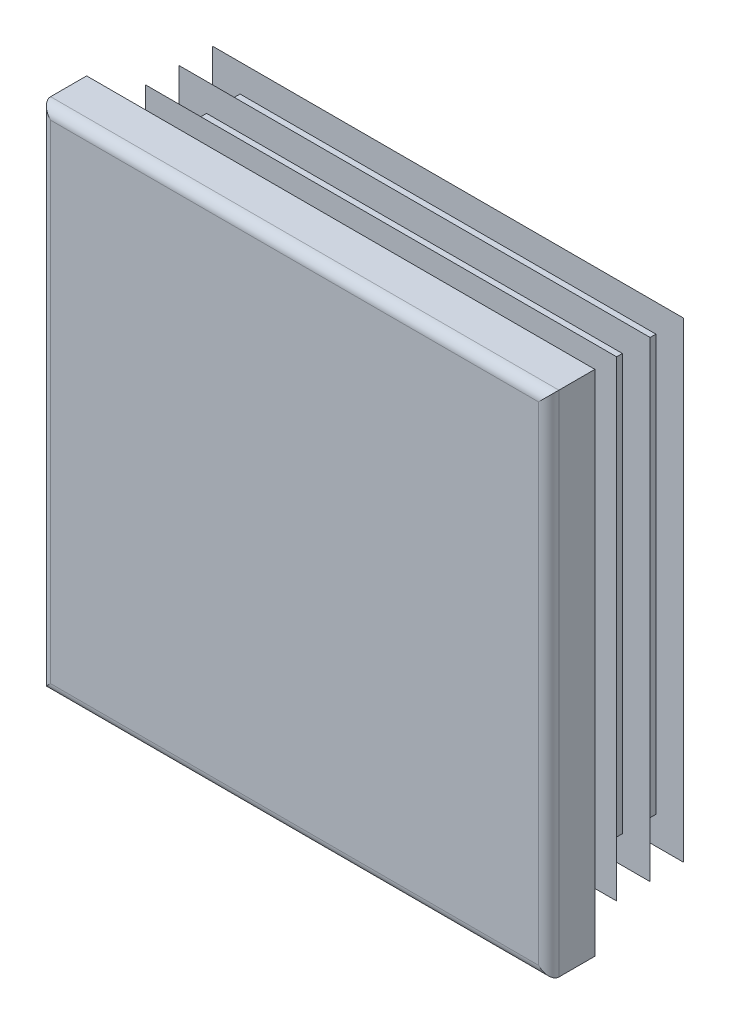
ISO-10303-21;
HEADER;
FILE_DESCRIPTION(('STEP AP214'),'2;1');
FILE_NAME('part.step','',(''),(''),'','','');
FILE_SCHEMA(('AUTOMOTIVE_DESIGN { 1 0 10303 214 1 1 1 1 }'));
ENDSEC;
DATA;
#1=APPLICATION_CONTEXT('core data for automotive mechanical design processes');
#2=APPLICATION_PROTOCOL_DEFINITION('international standard','automotive_design',2000,#1);
#3=PRODUCT_CONTEXT('',#1,'mechanical');
#4=PRODUCT('Part','Part','',(#3));
#5=PRODUCT_RELATED_PRODUCT_CATEGORY('part','',(#4));
#6=PRODUCT_DEFINITION_FORMATION('','',#4);
#7=PRODUCT_DEFINITION_CONTEXT('part definition',#1,'design');
#8=PRODUCT_DEFINITION('design','',#6,#7);
#9=PRODUCT_DEFINITION_SHAPE('','',#8);
#10=(LENGTH_UNIT() NAMED_UNIT(*) SI_UNIT(.MILLI.,.METRE.));
#11=(NAMED_UNIT(*) PLANE_ANGLE_UNIT() SI_UNIT($,.RADIAN.));
#12=(NAMED_UNIT(*) SI_UNIT($,.STERADIAN.) SOLID_ANGLE_UNIT());
#13=UNCERTAINTY_MEASURE_WITH_UNIT(LENGTH_MEASURE(1.E-05),#10,'distance_accuracy_value','');
#14=(GEOMETRIC_REPRESENTATION_CONTEXT(3) GLOBAL_UNCERTAINTY_ASSIGNED_CONTEXT((#13)) GLOBAL_UNIT_ASSIGNED_CONTEXT((#10,
#11,#12)) REPRESENTATION_CONTEXT('',''));
#15=CARTESIAN_POINT('',(0.,0.,0.));
#16=DIRECTION('',(0.,0.,1.));
#17=DIRECTION('',(1.,0.,0.));
#18=AXIS2_PLACEMENT_3D('',#15,#16,#17);
#19=CARTESIAN_POINT('',(26.4,-27.5,5.));
#20=DIRECTION('',(0.,0.,-1.));
#21=DIRECTION('',(0.,1.,0.));
#22=AXIS2_PLACEMENT_3D('',#19,#20,#21);
#23=PLANE('',#22);
#24=DIRECTION('',(0.,1.,0.));
#25=VECTOR('',#24,1.);
#26=CARTESIAN_POINT('',(-26.4,-27.5,5.));
#27=LINE('',#26,#25);
#28=CARTESIAN_POINT('',(-26.4,-26.4,5.));
#29=VERTEX_POINT('',#28);
#30=CARTESIAN_POINT('',(-26.4,26.4,5.));
#31=VERTEX_POINT('',#30);
#32=EDGE_CURVE('E262',#29,#31,#27,.T.);
#33=ORIENTED_EDGE('',*,*,#32,.F.);
#34=DIRECTION('',(-1.,0.,0.));
#35=VECTOR('',#34,1.);
#36=CARTESIAN_POINT('',(27.5,-26.4,5.));
#37=LINE('',#36,#35);
#38=CARTESIAN_POINT('',(26.4,-26.4,5.));
#39=VERTEX_POINT('',#38);
#40=EDGE_CURVE('E432',#39,#29,#37,.T.);
#41=ORIENTED_EDGE('',*,*,#40,.F.);
#42=DIRECTION('',(0.,1.,0.));
#43=VECTOR('',#42,1.);
#44=CARTESIAN_POINT('',(26.4,-27.5,5.));
#45=LINE('',#44,#43);
#46=CARTESIAN_POINT('',(26.4,26.4,5.));
#47=VERTEX_POINT('',#46);
#48=EDGE_CURVE('E257',#39,#47,#45,.T.);
#49=ORIENTED_EDGE('',*,*,#48,.T.);
#50=DIRECTION('',(-1.,0.,0.));
#51=VECTOR('',#50,1.);
#52=CARTESIAN_POINT('',(27.5,26.4,5.));
#53=LINE('',#52,#51);
#54=EDGE_CURVE('E534',#47,#31,#53,.T.);
#55=ORIENTED_EDGE('',*,*,#54,.T.);
#56=EDGE_LOOP('',(#33,#41,#49,#55));
#57=FACE_BOUND('',#56,.T.);
#58=ADVANCED_FACE('F14',(#57),#23,.F.);
#59=CARTESIAN_POINT('',(-26.4,-27.5,3.9));
#60=DIRECTION('',(0.,1.,0.));
#61=DIRECTION('',(-1.,0.,0.));
#62=AXIS2_PLACEMENT_3D('',#59,#60,#61);
#63=CYLINDRICAL_SURFACE('',#62,1.1);
#64=DIRECTION('',(0.,1.,0.));
#65=VECTOR('',#64,1.);
#66=CARTESIAN_POINT('',(-27.5,-27.5,3.9));
#67=LINE('',#66,#65);
#68=CARTESIAN_POINT('',(-27.5,-27.5,3.9));
#69=VERTEX_POINT('',#68);
#70=CARTESIAN_POINT('',(-27.5,27.5,3.9));
#71=VERTEX_POINT('',#70);
#72=EDGE_CURVE('E354',#69,#71,#67,.T.);
#73=ORIENTED_EDGE('',*,*,#72,.F.);
#74=CARTESIAN_POINT('',(-26.4,-26.4,3.9));
#75=DIRECTION('',(-0.707106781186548,0.707106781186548,0.));
#76=DIRECTION('',(0.707106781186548,0.707106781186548,0.));
#77=AXIS2_PLACEMENT_3D('',#74,#75,#76);
#78=ELLIPSE('',#77,1.55563491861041,1.1);
#79=EDGE_CURVE('E59',#69,#29,#78,.T.);
#80=ORIENTED_EDGE('',*,*,#79,.T.);
#81=ORIENTED_EDGE('',*,*,#32,.T.);
#82=CARTESIAN_POINT('',(-26.4,26.4,3.9));
#83=DIRECTION('',(0.707106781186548,0.707106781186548,0.));
#84=DIRECTION('',(-0.707106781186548,0.707106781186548,0.));
#85=AXIS2_PLACEMENT_3D('',#82,#83,#84);
#86=ELLIPSE('',#85,1.55563491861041,1.1);
#87=EDGE_CURVE('E258',#31,#71,#86,.F.);
#88=ORIENTED_EDGE('',*,*,#87,.T.);
#89=EDGE_LOOP('',(#73,#80,#81,#88));
#90=FACE_BOUND('',#89,.T.);
#91=ADVANCED_FACE('F16',(#90),#63,.T.);
#92=CARTESIAN_POINT('',(-27.5,-27.5,3.9));
#93=DIRECTION('',(1.,0.,0.));
#94=DIRECTION('',(0.,1.,0.));
#95=AXIS2_PLACEMENT_3D('',#92,#93,#94);
#96=PLANE('',#95);
#97=DIRECTION('',(0.,0.,-1.));
#98=VECTOR('',#97,1.);
#99=CARTESIAN_POINT('',(-27.5,27.5,3.9));
#100=LINE('',#99,#98);
#101=CARTESIAN_POINT('',(-27.5,27.5,0.));
#102=VERTEX_POINT('',#101);
#103=EDGE_CURVE('E519',#71,#102,#100,.T.);
#104=ORIENTED_EDGE('',*,*,#103,.T.);
#105=DIRECTION('',(0.,1.,0.));
#106=VECTOR('',#105,1.);
#107=CARTESIAN_POINT('',(-27.5,-27.5,0.));
#108=LINE('',#107,#106);
#109=CARTESIAN_POINT('',(-27.5,-27.5,0.));
#110=VERTEX_POINT('',#109);
#111=EDGE_CURVE('E352',#110,#102,#108,.T.);
#112=ORIENTED_EDGE('',*,*,#111,.F.);
#113=DIRECTION('',(0.,0.,-1.));
#114=VECTOR('',#113,1.);
#115=CARTESIAN_POINT('',(-27.5,-27.5,3.9));
#116=LINE('',#115,#114);
#117=EDGE_CURVE('E520',#69,#110,#116,.T.);
#118=ORIENTED_EDGE('',*,*,#117,.F.);
#119=ORIENTED_EDGE('',*,*,#72,.T.);
#120=EDGE_LOOP('',(#104,#112,#118,#119));
#121=FACE_BOUND('',#120,.T.);
#122=ADVANCED_FACE('F604',(#121),#96,.F.);
#123=CARTESIAN_POINT('',(-22.5,-27.5,0.));
#124=DIRECTION('',(1.,0.,0.));
#125=DIRECTION('',(0.,1.,0.));
#126=AXIS2_PLACEMENT_3D('',#123,#124,#125);
#127=PLANE('',#126);
#128=DIRECTION('',(0.,1.,0.));
#129=VECTOR('',#128,1.);
#130=CARTESIAN_POINT('',(-22.5,-27.5,0.));
#131=LINE('',#130,#129);
#132=CARTESIAN_POINT('',(-22.5,-22.5,0.));
#133=VERTEX_POINT('',#132);
#134=CARTESIAN_POINT('',(-22.5,22.5,0.));
#135=VERTEX_POINT('',#134);
#136=EDGE_CURVE('E349',#133,#135,#131,.T.);
#137=ORIENTED_EDGE('',*,*,#136,.T.);
#138=DIRECTION('',(0.,0.,-1.));
#139=VECTOR('',#138,1.);
#140=CARTESIAN_POINT('',(-22.5,22.5,0.));
#141=LINE('',#140,#139);
#142=CARTESIAN_POINT('',(-22.5,22.5,-0.725));
#143=VERTEX_POINT('',#142);
#144=EDGE_CURVE('E445',#135,#143,#141,.T.);
#145=ORIENTED_EDGE('',*,*,#144,.T.);
#146=DIRECTION('',(0.,1.,0.));
#147=VECTOR('',#146,1.);
#148=CARTESIAN_POINT('',(-22.5,-27.5,-0.725));
#149=LINE('',#148,#147);
#150=CARTESIAN_POINT('',(-22.5,-22.5,-0.725));
#151=VERTEX_POINT('',#150);
#152=EDGE_CURVE('E346',#151,#143,#149,.T.);
#153=ORIENTED_EDGE('',*,*,#152,.F.);
#154=DIRECTION('',(0.,0.,1.));
#155=VECTOR('',#154,1.);
#156=CARTESIAN_POINT('',(-22.5,-22.5,0.));
#157=LINE('',#156,#155);
#158=EDGE_CURVE('E439',#151,#133,#157,.T.);
#159=ORIENTED_EDGE('',*,*,#158,.T.);
#160=EDGE_LOOP('',(#137,#145,#153,#159));
#161=FACE_BOUND('',#160,.T.);
#162=ADVANCED_FACE('F728',(#161),#127,.F.);
#163=CARTESIAN_POINT('',(-25.5,-27.5,-0.725));
#164=DIRECTION('',(0.573576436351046,0.,0.819152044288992));
#165=DIRECTION('',(-0.819152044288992,0.,0.573576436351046));
#166=AXIS2_PLACEMENT_3D('',#163,#164,#165);
#167=PLANE('',#166);
#168=DIRECTION('',(0.,1.,0.));
#169=VECTOR('',#168,1.);
#170=CARTESIAN_POINT('',(-25.5,-27.5,-0.725));
#171=LINE('',#170,#169);
#172=CARTESIAN_POINT('',(-25.5,-25.5,-0.725));
#173=VERTEX_POINT('',#172);
#174=CARTESIAN_POINT('',(-25.5,25.5,-0.725));
#175=VERTEX_POINT('',#174);
#176=EDGE_CURVE('E344',#173,#175,#171,.T.);
#177=ORIENTED_EDGE('',*,*,#176,.T.);
#178=DIRECTION('',(0.633687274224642,-0.633687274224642,-0.443712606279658));
#179=VECTOR('',#178,1.);
#180=CARTESIAN_POINT('',(-4.2173432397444,4.21734323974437,-15.6272766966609));
#181=LINE('',#180,#179);
#182=CARTESIAN_POINT('',(-22.5,22.5,-2.82562261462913));
#183=VERTEX_POINT('',#182);
#184=EDGE_CURVE('E457',#175,#183,#181,.T.);
#185=ORIENTED_EDGE('',*,*,#184,.T.);
#186=DIRECTION('',(0.,1.,0.));
#187=VECTOR('',#186,1.);
#188=CARTESIAN_POINT('',(-22.5,-27.5,-2.82562261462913));
#189=LINE('',#188,#187);
#190=CARTESIAN_POINT('',(-22.5,-22.5,-2.82562261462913));
#191=VERTEX_POINT('',#190);
#192=EDGE_CURVE('E341',#191,#183,#189,.T.);
#193=ORIENTED_EDGE('',*,*,#192,.F.);
#194=DIRECTION('',(-0.633687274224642,-0.633687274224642,0.443712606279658));
#195=VECTOR('',#194,1.);
#196=CARTESIAN_POINT('',(-26.3031191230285,-26.3031191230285,-0.162649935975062));
#197=LINE('',#196,#195);
#198=EDGE_CURVE('E451',#191,#173,#197,.T.);
#199=ORIENTED_EDGE('',*,*,#198,.T.);
#200=EDGE_LOOP('',(#177,#185,#193,#199));
#201=FACE_BOUND('',#200,.T.);
#202=ADVANCED_FACE('F732',(#201),#167,.F.);
#203=CARTESIAN_POINT('',(-22.5,-27.5,-2.82562261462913));
#204=DIRECTION('',(1.,0.,0.));
#205=DIRECTION('',(0.,1.,0.));
#206=AXIS2_PLACEMENT_3D('',#203,#204,#205);
#207=PLANE('',#206);
#208=ORIENTED_EDGE('',*,*,#192,.T.);
#209=DIRECTION('',(0.,0.,-1.));
#210=VECTOR('',#209,1.);
#211=CARTESIAN_POINT('',(-22.5,22.5,-2.82562261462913));
#212=LINE('',#211,#210);
#213=CARTESIAN_POINT('',(-22.5,22.5,-4.35));
#214=VERTEX_POINT('',#213);
#215=EDGE_CURVE('E463',#183,#214,#212,.T.);
#216=ORIENTED_EDGE('',*,*,#215,.T.);
#217=DIRECTION('',(0.,1.,0.));
#218=VECTOR('',#217,1.);
#219=CARTESIAN_POINT('',(-22.5,-27.5,-4.35));
#220=LINE('',#219,#218);
#221=CARTESIAN_POINT('',(-22.5,-22.5,-4.35));
#222=VERTEX_POINT('',#221);
#223=EDGE_CURVE('E338',#222,#214,#220,.T.);
#224=ORIENTED_EDGE('',*,*,#223,.F.);
#225=DIRECTION('',(0.,0.,1.));
#226=VECTOR('',#225,1.);
#227=CARTESIAN_POINT('',(-22.5,-22.5,-2.82562261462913));
#228=LINE('',#227,#226);
#229=EDGE_CURVE('E460',#222,#191,#228,.T.);
#230=ORIENTED_EDGE('',*,*,#229,.T.);
#231=EDGE_LOOP('',(#208,#216,#224,#230));
#232=FACE_BOUND('',#231,.T.);
#233=ADVANCED_FACE('F738',(#232),#207,.F.);
#234=CARTESIAN_POINT('',(-25.5,-27.5,-4.35));
#235=DIRECTION('',(0.573576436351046,0.,0.819152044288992));
#236=DIRECTION('',(-0.819152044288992,0.,0.573576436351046));
#237=AXIS2_PLACEMENT_3D('',#234,#235,#236);
#238=PLANE('',#237);
#239=DIRECTION('',(0.,1.,0.));
#240=VECTOR('',#239,1.);
#241=CARTESIAN_POINT('',(-25.5,-27.5,-4.35));
#242=LINE('',#241,#240);
#243=CARTESIAN_POINT('',(-25.5,-25.5,-4.35));
#244=VERTEX_POINT('',#243);
#245=CARTESIAN_POINT('',(-25.5,25.5,-4.35));
#246=VERTEX_POINT('',#245);
#247=EDGE_CURVE('E336',#244,#246,#242,.T.);
#248=ORIENTED_EDGE('',*,*,#247,.T.);
#249=DIRECTION('',(0.633687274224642,-0.633687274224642,-0.443712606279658));
#250=VECTOR('',#249,1.);
#251=CARTESIAN_POINT('',(-4.21734323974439,4.2173432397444,-19.2522766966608));
#252=LINE('',#251,#250);
#253=CARTESIAN_POINT('',(-22.5,22.5,-6.45062261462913));
#254=VERTEX_POINT('',#253);
#255=EDGE_CURVE('E475',#246,#254,#252,.T.);
#256=ORIENTED_EDGE('',*,*,#255,.T.);
#257=DIRECTION('',(0.,1.,0.));
#258=VECTOR('',#257,1.);
#259=CARTESIAN_POINT('',(-22.5,-27.5,-6.45062261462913));
#260=LINE('',#259,#258);
#261=CARTESIAN_POINT('',(-22.5,-22.5,-6.45062261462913));
#262=VERTEX_POINT('',#261);
#263=EDGE_CURVE('E333',#262,#254,#260,.T.);
#264=ORIENTED_EDGE('',*,*,#263,.F.);
#265=DIRECTION('',(-0.633687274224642,-0.633687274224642,0.443712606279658));
#266=VECTOR('',#265,1.);
#267=CARTESIAN_POINT('',(-26.3031191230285,-26.3031191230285,-3.78764993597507));
#268=LINE('',#267,#266);
#269=EDGE_CURVE('E469',#262,#244,#268,.T.);
#270=ORIENTED_EDGE('',*,*,#269,.T.);
#271=EDGE_LOOP('',(#248,#256,#264,#270));
#272=FACE_BOUND('',#271,.T.);
#273=ADVANCED_FACE('F742',(#272),#238,.F.);
#274=CARTESIAN_POINT('',(-22.5,-27.5,-6.45062261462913));
#275=DIRECTION('',(1.,0.,0.));
#276=DIRECTION('',(0.,1.,0.));
#277=AXIS2_PLACEMENT_3D('',#274,#275,#276);
#278=PLANE('',#277);
#279=ORIENTED_EDGE('',*,*,#263,.T.);
#280=DIRECTION('',(0.,0.,-1.));
#281=VECTOR('',#280,1.);
#282=CARTESIAN_POINT('',(-22.5,22.5,-6.45062261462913));
#283=LINE('',#282,#281);
#284=CARTESIAN_POINT('',(-22.5,22.5,-7.975));
#285=VERTEX_POINT('',#284);
#286=EDGE_CURVE('E481',#254,#285,#283,.T.);
#287=ORIENTED_EDGE('',*,*,#286,.T.);
#288=DIRECTION('',(0.,1.,0.));
#289=VECTOR('',#288,1.);
#290=CARTESIAN_POINT('',(-22.5,-27.5,-7.975));
#291=LINE('',#290,#289);
#292=CARTESIAN_POINT('',(-22.5,-22.5,-7.975));
#293=VERTEX_POINT('',#292);
#294=EDGE_CURVE('E330',#293,#285,#291,.T.);
#295=ORIENTED_EDGE('',*,*,#294,.F.);
#296=DIRECTION('',(0.,0.,1.));
#297=VECTOR('',#296,1.);
#298=CARTESIAN_POINT('',(-22.5,-22.5,-6.45062261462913));
#299=LINE('',#298,#297);
#300=EDGE_CURVE('E478',#293,#262,#299,.T.);
#301=ORIENTED_EDGE('',*,*,#300,.T.);
#302=EDGE_LOOP('',(#279,#287,#295,#301));
#303=FACE_BOUND('',#302,.T.);
#304=ADVANCED_FACE('F746',(#303),#278,.F.);
#305=CARTESIAN_POINT('',(-25.5,-27.5,-7.975));
#306=DIRECTION('',(0.573576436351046,0.,0.819152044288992));
#307=DIRECTION('',(-0.819152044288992,0.,0.573576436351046));
#308=AXIS2_PLACEMENT_3D('',#305,#306,#307);
#309=PLANE('',#308);
#310=DIRECTION('',(0.,1.,0.));
#311=VECTOR('',#310,1.);
#312=CARTESIAN_POINT('',(-25.5,-27.5,-7.975));
#313=LINE('',#312,#311);
#314=CARTESIAN_POINT('',(-25.5,-25.5,-7.975));
#315=VERTEX_POINT('',#314);
#316=CARTESIAN_POINT('',(-25.5,25.5,-7.975));
#317=VERTEX_POINT('',#316);
#318=EDGE_CURVE('E328',#315,#317,#313,.T.);
#319=ORIENTED_EDGE('',*,*,#318,.T.);
#320=DIRECTION('',(0.633687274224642,-0.633687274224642,-0.443712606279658));
#321=VECTOR('',#320,1.);
#322=CARTESIAN_POINT('',(-4.2173432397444,4.2173432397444,-22.8772766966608));
#323=LINE('',#322,#321);
#324=CARTESIAN_POINT('',(-22.5,22.5,-10.0756226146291));
#325=VERTEX_POINT('',#324);
#326=EDGE_CURVE('E493',#317,#325,#323,.T.);
#327=ORIENTED_EDGE('',*,*,#326,.T.);
#328=DIRECTION('',(0.,1.,0.));
#329=VECTOR('',#328,1.);
#330=CARTESIAN_POINT('',(-22.5,-27.5,-10.0756226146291));
#331=LINE('',#330,#329);
#332=CARTESIAN_POINT('',(-22.5,-22.5,-10.0756226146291));
#333=VERTEX_POINT('',#332);
#334=EDGE_CURVE('E325',#333,#325,#331,.T.);
#335=ORIENTED_EDGE('',*,*,#334,.F.);
#336=DIRECTION('',(-0.633687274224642,-0.633687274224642,0.443712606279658));
#337=VECTOR('',#336,1.);
#338=CARTESIAN_POINT('',(-26.3031191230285,-26.3031191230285,-7.41264993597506));
#339=LINE('',#338,#337);
#340=EDGE_CURVE('E487',#333,#315,#339,.T.);
#341=ORIENTED_EDGE('',*,*,#340,.T.);
#342=EDGE_LOOP('',(#319,#327,#335,#341));
#343=FACE_BOUND('',#342,.T.);
#344=ADVANCED_FACE('F668',(#343),#309,.F.);
#345=CARTESIAN_POINT('',(-22.5,-27.5,-10.0756226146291));
#346=DIRECTION('',(1.,0.,0.));
#347=DIRECTION('',(0.,1.,0.));
#348=AXIS2_PLACEMENT_3D('',#345,#346,#347);
#349=PLANE('',#348);
#350=ORIENTED_EDGE('',*,*,#334,.T.);
#351=DIRECTION('',(0.,0.,-1.));
#352=VECTOR('',#351,1.);
#353=CARTESIAN_POINT('',(-22.5,22.5,-10.0756226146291));
#354=LINE('',#353,#352);
#355=CARTESIAN_POINT('',(-22.5,22.5,-11.6));
#356=VERTEX_POINT('',#355);
#357=EDGE_CURVE('E499',#325,#356,#354,.T.);
#358=ORIENTED_EDGE('',*,*,#357,.T.);
#359=DIRECTION('',(0.,1.,0.));
#360=VECTOR('',#359,1.);
#361=CARTESIAN_POINT('',(-22.5,-27.5,-11.6));
#362=LINE('',#361,#360);
#363=CARTESIAN_POINT('',(-22.5,-22.5,-11.6));
#364=VERTEX_POINT('',#363);
#365=EDGE_CURVE('E322',#364,#356,#362,.T.);
#366=ORIENTED_EDGE('',*,*,#365,.F.);
#367=DIRECTION('',(0.,0.,1.));
#368=VECTOR('',#367,1.);
#369=CARTESIAN_POINT('',(-22.5,-22.5,-10.0756226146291));
#370=LINE('',#369,#368);
#371=EDGE_CURVE('E496',#364,#333,#370,.T.);
#372=ORIENTED_EDGE('',*,*,#371,.T.);
#373=EDGE_LOOP('',(#350,#358,#366,#372));
#374=FACE_BOUND('',#373,.T.);
#375=ADVANCED_FACE('F665',(#374),#349,.F.);
#376=CARTESIAN_POINT('',(-25.5,-27.5,-11.6));
#377=DIRECTION('',(0.573576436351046,0.,0.819152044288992));
#378=DIRECTION('',(-0.819152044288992,0.,0.573576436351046));
#379=AXIS2_PLACEMENT_3D('',#376,#377,#378);
#380=PLANE('',#379);
#381=DIRECTION('',(0.,1.,0.));
#382=VECTOR('',#381,1.);
#383=CARTESIAN_POINT('',(-25.5,-27.5,-11.6));
#384=LINE('',#383,#382);
#385=CARTESIAN_POINT('',(-25.5,-25.5,-11.6));
#386=VERTEX_POINT('',#385);
#387=CARTESIAN_POINT('',(-25.5,25.5,-11.6));
#388=VERTEX_POINT('',#387);
#389=EDGE_CURVE('E320',#386,#388,#384,.T.);
#390=ORIENTED_EDGE('',*,*,#389,.T.);
#391=DIRECTION('',(0.633687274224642,-0.633687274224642,-0.443712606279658));
#392=VECTOR('',#391,1.);
#393=CARTESIAN_POINT('',(-4.2173432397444,4.2173432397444,-26.5022766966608));
#394=LINE('',#393,#392);
#395=CARTESIAN_POINT('',(-22.5,22.5,-13.7006226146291));
#396=VERTEX_POINT('',#395);
#397=EDGE_CURVE('E511',#388,#396,#394,.T.);
#398=ORIENTED_EDGE('',*,*,#397,.T.);
#399=DIRECTION('',(0.,1.,0.));
#400=VECTOR('',#399,1.);
#401=CARTESIAN_POINT('',(-22.5,-27.5,-13.7006226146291));
#402=LINE('',#401,#400);
#403=CARTESIAN_POINT('',(-22.5,-22.5,-13.7006226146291));
#404=VERTEX_POINT('',#403);
#405=EDGE_CURVE('E317',#404,#396,#402,.T.);
#406=ORIENTED_EDGE('',*,*,#405,.F.);
#407=DIRECTION('',(-0.633687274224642,-0.633687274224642,0.443712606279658));
#408=VECTOR('',#407,1.);
#409=CARTESIAN_POINT('',(-26.3031191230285,-26.3031191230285,-11.0376499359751));
#410=LINE('',#409,#408);
#411=EDGE_CURVE('E505',#404,#386,#410,.T.);
#412=ORIENTED_EDGE('',*,*,#411,.T.);
#413=EDGE_LOOP('',(#390,#398,#406,#412));
#414=FACE_BOUND('',#413,.T.);
#415=ADVANCED_FACE('F580',(#414),#380,.F.);
#416=CARTESIAN_POINT('',(-22.5,-27.5,-13.7006226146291));
#417=DIRECTION('',(1.,0.,0.));
#418=DIRECTION('',(0.,1.,0.));
#419=AXIS2_PLACEMENT_3D('',#416,#417,#418);
#420=PLANE('',#419);
#421=ORIENTED_EDGE('',*,*,#405,.T.);
#422=DIRECTION('',(0.,0.,-1.));
#423=VECTOR('',#422,1.);
#424=CARTESIAN_POINT('',(-22.5,22.5,-13.7006226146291));
#425=LINE('',#424,#423);
#426=CARTESIAN_POINT('',(-22.5,22.5,-14.5));
#427=VERTEX_POINT('',#426);
#428=EDGE_CURVE('E517',#396,#427,#425,.T.);
#429=ORIENTED_EDGE('',*,*,#428,.T.);
#430=DIRECTION('',(0.,1.,0.));
#431=VECTOR('',#430,1.);
#432=CARTESIAN_POINT('',(-22.5,-27.5,-14.5));
#433=LINE('',#432,#431);
#434=CARTESIAN_POINT('',(-22.5,-22.5,-14.5));
#435=VERTEX_POINT('',#434);
#436=EDGE_CURVE('E314',#435,#427,#433,.T.);
#437=ORIENTED_EDGE('',*,*,#436,.F.);
#438=DIRECTION('',(0.,0.,1.));
#439=VECTOR('',#438,1.);
#440=CARTESIAN_POINT('',(-22.5,-22.5,-13.7006226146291));
#441=LINE('',#440,#439);
#442=EDGE_CURVE('E514',#435,#404,#441,.T.);
#443=ORIENTED_EDGE('',*,*,#442,.T.);
#444=EDGE_LOOP('',(#421,#429,#437,#443));
#445=FACE_BOUND('',#444,.T.);
#446=ADVANCED_FACE('F582',(#445),#420,.F.);
#447=CARTESIAN_POINT('',(-22.5,-27.5,-14.5));
#448=DIRECTION('',(0.,0.,1.));
#449=DIRECTION('',(0.,-1.,0.));
#450=AXIS2_PLACEMENT_3D('',#447,#448,#449);
#451=PLANE('',#450);
#452=ORIENTED_EDGE('',*,*,#436,.T.);
#453=DIRECTION('',(-1.,0.,0.));
#454=VECTOR('',#453,1.);
#455=CARTESIAN_POINT('',(27.5,22.5,-14.5));
#456=LINE('',#455,#454);
#457=CARTESIAN_POINT('',(22.5,22.5,-14.5));
#458=VERTEX_POINT('',#457);
#459=EDGE_CURVE('E388',#458,#427,#456,.T.);
#460=ORIENTED_EDGE('',*,*,#459,.F.);
#461=DIRECTION('',(0.,1.,0.));
#462=VECTOR('',#461,1.);
#463=CARTESIAN_POINT('',(22.5,-27.5,-14.5));
#464=LINE('',#463,#462);
#465=CARTESIAN_POINT('',(22.5,-22.5,-14.5));
#466=VERTEX_POINT('',#465);
#467=EDGE_CURVE('E311',#466,#458,#464,.T.);
#468=ORIENTED_EDGE('',*,*,#467,.F.);
#469=DIRECTION('',(-1.,0.,0.));
#470=VECTOR('',#469,1.);
#471=CARTESIAN_POINT('',(27.5,-22.5,-14.5));
#472=LINE('',#471,#470);
#473=EDGE_CURVE('E386',#466,#435,#472,.T.);
#474=ORIENTED_EDGE('',*,*,#473,.T.);
#475=EDGE_LOOP('',(#452,#460,#468,#474));
#476=FACE_BOUND('',#475,.T.);
#477=ADVANCED_FACE('F385',(#476),#451,.F.);
#478=CARTESIAN_POINT('',(22.5,-27.5,-14.5));
#479=DIRECTION('',(-1.,0.,0.));
#480=DIRECTION('',(0.,-1.,0.));
#481=AXIS2_PLACEMENT_3D('',#478,#479,#480);
#482=PLANE('',#481);
#483=ORIENTED_EDGE('',*,*,#467,.T.);
#484=DIRECTION('',(0.,0.,1.));
#485=VECTOR('',#484,1.);
#486=CARTESIAN_POINT('',(22.5,22.5,-14.5));
#487=LINE('',#486,#485);
#488=CARTESIAN_POINT('',(22.5,22.5,-13.7006226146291));
#489=VERTEX_POINT('',#488);
#490=EDGE_CURVE('E9',#458,#489,#487,.T.);
#491=ORIENTED_EDGE('',*,*,#490,.T.);
#492=DIRECTION('',(0.,1.,0.));
#493=VECTOR('',#492,1.);
#494=CARTESIAN_POINT('',(22.5,-27.5,-13.7006226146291));
#495=LINE('',#494,#493);
#496=CARTESIAN_POINT('',(22.5,-22.5,-13.7006226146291));
#497=VERTEX_POINT('',#496);
#498=EDGE_CURVE('E308',#497,#489,#495,.T.);
#499=ORIENTED_EDGE('',*,*,#498,.F.);
#500=DIRECTION('',(0.,0.,-1.));
#501=VECTOR('',#500,1.);
#502=CARTESIAN_POINT('',(22.5,-22.5,-14.5));
#503=LINE('',#502,#501);
#504=EDGE_CURVE('E23',#497,#466,#503,.T.);
#505=ORIENTED_EDGE('',*,*,#504,.T.);
#506=EDGE_LOOP('',(#483,#491,#499,#505));
#507=FACE_BOUND('',#506,.T.);
#508=ADVANCED_FACE('F378',(#507),#482,.F.);
#509=CARTESIAN_POINT('',(22.5,-27.5,-13.7006226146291));
#510=DIRECTION('',(-0.573576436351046,0.,0.819152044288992));
#511=DIRECTION('',(-0.819152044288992,0.,-0.573576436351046));
#512=AXIS2_PLACEMENT_3D('',#509,#510,#511);
#513=PLANE('',#512);
#514=ORIENTED_EDGE('',*,*,#498,.T.);
#515=DIRECTION('',(0.633687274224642,0.633687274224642,0.443712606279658));
#516=VECTOR('',#515,1.);
#517=CARTESIAN_POINT('',(2.42202192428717,2.42202192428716,-27.7593742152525));
#518=LINE('',#517,#516);
#519=CARTESIAN_POINT('',(25.5,25.5,-11.6));
#520=VERTEX_POINT('',#519);
#521=EDGE_CURVE('E508',#489,#520,#518,.T.);
#522=ORIENTED_EDGE('',*,*,#521,.T.);
#523=DIRECTION('',(0.,1.,0.));
#524=VECTOR('',#523,1.);
#525=CARTESIAN_POINT('',(25.5,-27.5,-11.6));
#526=LINE('',#525,#524);
#527=CARTESIAN_POINT('',(25.5,-25.5,-11.6));
#528=VERTEX_POINT('',#527);
#529=EDGE_CURVE('E305',#528,#520,#526,.T.);
#530=ORIENTED_EDGE('',*,*,#529,.F.);
#531=DIRECTION('',(-0.633687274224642,0.633687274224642,-0.443712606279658));
#532=VECTOR('',#531,1.);
#533=CARTESIAN_POINT('',(24.5077978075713,-24.5077978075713,-12.2947474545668));
#534=LINE('',#533,#532);
#535=EDGE_CURVE('E502',#528,#497,#534,.T.);
#536=ORIENTED_EDGE('',*,*,#535,.T.);
#537=EDGE_LOOP('',(#514,#522,#530,#536));
#538=FACE_BOUND('',#537,.T.);
#539=ADVANCED_FACE('F588',(#538),#513,.F.);
#540=CARTESIAN_POINT('',(25.5,-27.5,-11.6));
#541=DIRECTION('',(0.,0.,-1.));
#542=DIRECTION('',(0.,1.,0.));
#543=AXIS2_PLACEMENT_3D('',#540,#541,#542);
#544=PLANE('',#543);
#545=ORIENTED_EDGE('',*,*,#529,.T.);
#546=DIRECTION('',(-1.,0.,0.));
#547=VECTOR('',#546,1.);
#548=CARTESIAN_POINT('',(27.5,25.5,-11.6));
#549=LINE('',#548,#547);
#550=EDGE_CURVE('E394',#520,#388,#549,.T.);
#551=ORIENTED_EDGE('',*,*,#550,.T.);
#552=ORIENTED_EDGE('',*,*,#389,.F.);
#553=DIRECTION('',(-1.,0.,0.));
#554=VECTOR('',#553,1.);
#555=CARTESIAN_POINT('',(27.5,-25.5,-11.6));
#556=LINE('',#555,#554);
#557=EDGE_CURVE('E401',#528,#386,#556,.T.);
#558=ORIENTED_EDGE('',*,*,#557,.F.);
#559=EDGE_LOOP('',(#545,#551,#552,#558));
#560=FACE_BOUND('',#559,.T.);
#561=ORIENTED_EDGE('',*,*,#365,.T.);
#562=DIRECTION('',(-1.,0.,0.));
#563=VECTOR('',#562,1.);
#564=CARTESIAN_POINT('',(27.5,22.5,-11.6));
#565=LINE('',#564,#563);
#566=CARTESIAN_POINT('',(22.5,22.5,-11.6));
#567=VERTEX_POINT('',#566);
#568=EDGE_CURVE('E567',#567,#356,#565,.T.);
#569=ORIENTED_EDGE('',*,*,#568,.F.);
#570=DIRECTION('',(0.,1.,0.));
#571=VECTOR('',#570,1.);
#572=CARTESIAN_POINT('',(22.5,-27.5,-11.6));
#573=LINE('',#572,#571);
#574=CARTESIAN_POINT('',(22.5,-22.5,-11.6));
#575=VERTEX_POINT('',#574);
#576=EDGE_CURVE('E302',#575,#567,#573,.T.);
#577=ORIENTED_EDGE('',*,*,#576,.F.);
#578=DIRECTION('',(-1.,0.,0.));
#579=VECTOR('',#578,1.);
#580=CARTESIAN_POINT('',(27.5,-22.5,-11.6));
#581=LINE('',#580,#579);
#582=EDGE_CURVE('E403',#575,#364,#581,.T.);
#583=ORIENTED_EDGE('',*,*,#582,.T.);
#584=EDGE_LOOP('',(#561,#569,#577,#583));
#585=FACE_BOUND('',#584,.T.);
#586=ADVANCED_FACE('F571',(#560,#585),#544,.F.);
#587=CARTESIAN_POINT('',(22.5,-27.5,-11.6));
#588=DIRECTION('',(-1.,0.,0.));
#589=DIRECTION('',(0.,-1.,0.));
#590=AXIS2_PLACEMENT_3D('',#587,#588,#589);
#591=PLANE('',#590);
#592=ORIENTED_EDGE('',*,*,#576,.T.);
#593=DIRECTION('',(0.,0.,1.));
#594=VECTOR('',#593,1.);
#595=CARTESIAN_POINT('',(22.5,22.5,-11.6));
#596=LINE('',#595,#594);
#597=CARTESIAN_POINT('',(22.5,22.5,-10.0756226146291));
#598=VERTEX_POINT('',#597);
#599=EDGE_CURVE('E372',#567,#598,#596,.T.);
#600=ORIENTED_EDGE('',*,*,#599,.T.);
#601=DIRECTION('',(0.,1.,0.));
#602=VECTOR('',#601,1.);
#603=CARTESIAN_POINT('',(22.5,-27.5,-10.0756226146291));
#604=LINE('',#603,#602);
#605=CARTESIAN_POINT('',(22.5,-22.5,-10.0756226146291));
#606=VERTEX_POINT('',#605);
#607=EDGE_CURVE('E299',#606,#598,#604,.T.);
#608=ORIENTED_EDGE('',*,*,#607,.F.);
#609=DIRECTION('',(0.,0.,-1.));
#610=VECTOR('',#609,1.);
#611=CARTESIAN_POINT('',(22.5,-22.5,-11.6));
#612=LINE('',#611,#610);
#613=EDGE_CURVE('E369',#606,#575,#612,.T.);
#614=ORIENTED_EDGE('',*,*,#613,.T.);
#615=EDGE_LOOP('',(#592,#600,#608,#614));
#616=FACE_BOUND('',#615,.T.);
#617=ADVANCED_FACE('F596',(#616),#591,.F.);
#618=CARTESIAN_POINT('',(22.5,-27.5,-10.0756226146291));
#619=DIRECTION('',(-0.573576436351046,0.,0.819152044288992));
#620=DIRECTION('',(-0.819152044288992,0.,-0.573576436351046));
#621=AXIS2_PLACEMENT_3D('',#618,#619,#620);
#622=PLANE('',#621);
#623=ORIENTED_EDGE('',*,*,#607,.T.);
#624=DIRECTION('',(0.633687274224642,0.633687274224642,0.443712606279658));
#625=VECTOR('',#624,1.);
#626=CARTESIAN_POINT('',(2.42202192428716,2.42202192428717,-24.1343742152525));
#627=LINE('',#626,#625);
#628=CARTESIAN_POINT('',(25.5,25.5,-7.975));
#629=VERTEX_POINT('',#628);
#630=EDGE_CURVE('E490',#598,#629,#627,.T.);
#631=ORIENTED_EDGE('',*,*,#630,.T.);
#632=DIRECTION('',(0.,1.,0.));
#633=VECTOR('',#632,1.);
#634=CARTESIAN_POINT('',(25.5,-27.5,-7.975));
#635=LINE('',#634,#633);
#636=CARTESIAN_POINT('',(25.5,-25.5,-7.975));
#637=VERTEX_POINT('',#636);
#638=EDGE_CURVE('E296',#637,#629,#635,.T.);
#639=ORIENTED_EDGE('',*,*,#638,.F.);
#640=DIRECTION('',(-0.633687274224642,0.633687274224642,-0.443712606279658));
#641=VECTOR('',#640,1.);
#642=CARTESIAN_POINT('',(24.5077978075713,-24.5077978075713,-8.66974745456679));
#643=LINE('',#642,#641);
#644=EDGE_CURVE('E484',#637,#606,#643,.T.);
#645=ORIENTED_EDGE('',*,*,#644,.T.);
#646=EDGE_LOOP('',(#623,#631,#639,#645));
#647=FACE_BOUND('',#646,.T.);
#648=ADVANCED_FACE('F648',(#647),#622,.F.);
#649=CARTESIAN_POINT('',(25.5,-27.5,-7.975));
#650=DIRECTION('',(0.,0.,-1.));
#651=DIRECTION('',(0.,1.,0.));
#652=AXIS2_PLACEMENT_3D('',#649,#650,#651);
#653=PLANE('',#652);
#654=ORIENTED_EDGE('',*,*,#638,.T.);
#655=DIRECTION('',(-1.,0.,0.));
#656=VECTOR('',#655,1.);
#657=CARTESIAN_POINT('',(27.5,25.5,-7.975));
#658=LINE('',#657,#656);
#659=EDGE_CURVE('E561',#629,#317,#658,.T.);
#660=ORIENTED_EDGE('',*,*,#659,.T.);
#661=ORIENTED_EDGE('',*,*,#318,.F.);
#662=DIRECTION('',(-1.,0.,0.));
#663=VECTOR('',#662,1.);
#664=CARTESIAN_POINT('',(27.5,-25.5,-7.975));
#665=LINE('',#664,#663);
#666=EDGE_CURVE('E409',#637,#315,#665,.T.);
#667=ORIENTED_EDGE('',*,*,#666,.F.);
#668=EDGE_LOOP('',(#654,#660,#661,#667));
#669=FACE_BOUND('',#668,.T.);
#670=ORIENTED_EDGE('',*,*,#294,.T.);
#671=DIRECTION('',(-1.,0.,0.));
#672=VECTOR('',#671,1.);
#673=CARTESIAN_POINT('',(27.5,22.5,-7.975));
#674=LINE('',#673,#672);
#675=CARTESIAN_POINT('',(22.5,22.5,-7.975));
#676=VERTEX_POINT('',#675);
#677=EDGE_CURVE('E559',#676,#285,#674,.T.);
#678=ORIENTED_EDGE('',*,*,#677,.F.);
#679=DIRECTION('',(0.,1.,0.));
#680=VECTOR('',#679,1.);
#681=CARTESIAN_POINT('',(22.5,-27.5,-7.975));
#682=LINE('',#681,#680);
#683=CARTESIAN_POINT('',(22.5,-22.5,-7.975));
#684=VERTEX_POINT('',#683);
#685=EDGE_CURVE('E293',#684,#676,#682,.T.);
#686=ORIENTED_EDGE('',*,*,#685,.F.);
#687=DIRECTION('',(-1.,0.,0.));
#688=VECTOR('',#687,1.);
#689=CARTESIAN_POINT('',(27.5,-22.5,-7.975));
#690=LINE('',#689,#688);
#691=EDGE_CURVE('E411',#684,#293,#690,.T.);
#692=ORIENTED_EDGE('',*,*,#691,.T.);
#693=EDGE_LOOP('',(#670,#678,#686,#692));
#694=FACE_BOUND('',#693,.T.);
#695=ADVANCED_FACE('F644',(#669,#694),#653,.F.);
#696=CARTESIAN_POINT('',(22.5,-27.5,-7.975));
#697=DIRECTION('',(-1.,0.,0.));
#698=DIRECTION('',(0.,-1.,0.));
#699=AXIS2_PLACEMENT_3D('',#696,#697,#698);
#700=PLANE('',#699);
#701=ORIENTED_EDGE('',*,*,#685,.T.);
#702=DIRECTION('',(0.,0.,1.));
#703=VECTOR('',#702,1.);
#704=CARTESIAN_POINT('',(22.5,22.5,-7.975));
#705=LINE('',#704,#703);
#706=CARTESIAN_POINT('',(22.5,22.5,-6.45062261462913));
#707=VERTEX_POINT('',#706);
#708=EDGE_CURVE('E366',#676,#707,#705,.T.);
#709=ORIENTED_EDGE('',*,*,#708,.T.);
#710=DIRECTION('',(0.,1.,0.));
#711=VECTOR('',#710,1.);
#712=CARTESIAN_POINT('',(22.5,-27.5,-6.45062261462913));
#713=LINE('',#712,#711);
#714=CARTESIAN_POINT('',(22.5,-22.5,-6.45062261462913));
#715=VERTEX_POINT('',#714);
#716=EDGE_CURVE('E290',#715,#707,#713,.T.);
#717=ORIENTED_EDGE('',*,*,#716,.F.);
#718=DIRECTION('',(0.,0.,-1.));
#719=VECTOR('',#718,1.);
#720=CARTESIAN_POINT('',(22.5,-22.5,-7.975));
#721=LINE('',#720,#719);
#722=EDGE_CURVE('E363',#715,#684,#721,.T.);
#723=ORIENTED_EDGE('',*,*,#722,.T.);
#724=EDGE_LOOP('',(#701,#709,#717,#723));
#725=FACE_BOUND('',#724,.T.);
#726=ADVANCED_FACE('F640',(#725),#700,.F.);
#727=CARTESIAN_POINT('',(22.5,-27.5,-6.45062261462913));
#728=DIRECTION('',(-0.573576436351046,0.,0.819152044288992));
#729=DIRECTION('',(-0.819152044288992,0.,-0.573576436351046));
#730=AXIS2_PLACEMENT_3D('',#727,#728,#729);
#731=PLANE('',#730);
#732=ORIENTED_EDGE('',*,*,#716,.T.);
#733=DIRECTION('',(0.633687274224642,0.633687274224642,0.443712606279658));
#734=VECTOR('',#733,1.);
#735=CARTESIAN_POINT('',(2.42202192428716,2.42202192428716,-20.5093742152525));
#736=LINE('',#735,#734);
#737=CARTESIAN_POINT('',(25.5,25.5,-4.35));
#738=VERTEX_POINT('',#737);
#739=EDGE_CURVE('E472',#707,#738,#736,.T.);
#740=ORIENTED_EDGE('',*,*,#739,.T.);
#741=DIRECTION('',(0.,1.,0.));
#742=VECTOR('',#741,1.);
#743=CARTESIAN_POINT('',(25.5,-27.5,-4.35));
#744=LINE('',#743,#742);
#745=CARTESIAN_POINT('',(25.5,-25.5,-4.35));
#746=VERTEX_POINT('',#745);
#747=EDGE_CURVE('E287',#746,#738,#744,.T.);
#748=ORIENTED_EDGE('',*,*,#747,.F.);
#749=DIRECTION('',(-0.633687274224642,0.633687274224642,-0.443712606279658));
#750=VECTOR('',#749,1.);
#751=CARTESIAN_POINT('',(24.5077978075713,-24.5077978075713,-5.04474745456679));
#752=LINE('',#751,#750);
#753=EDGE_CURVE('E466',#746,#715,#752,.T.);
#754=ORIENTED_EDGE('',*,*,#753,.T.);
#755=EDGE_LOOP('',(#732,#740,#748,#754));
#756=FACE_BOUND('',#755,.T.);
#757=ADVANCED_FACE('F636',(#756),#731,.F.);
#758=CARTESIAN_POINT('',(25.5,-27.5,-4.35));
#759=DIRECTION('',(0.,0.,-1.));
#760=DIRECTION('',(0.,1.,0.));
#761=AXIS2_PLACEMENT_3D('',#758,#759,#760);
#762=PLANE('',#761);
#763=ORIENTED_EDGE('',*,*,#747,.T.);
#764=DIRECTION('',(-1.,0.,0.));
#765=VECTOR('',#764,1.);
#766=CARTESIAN_POINT('',(27.5,25.5,-4.35));
#767=LINE('',#766,#765);
#768=EDGE_CURVE('E553',#738,#246,#767,.T.);
#769=ORIENTED_EDGE('',*,*,#768,.T.);
#770=ORIENTED_EDGE('',*,*,#247,.F.);
#771=DIRECTION('',(-1.,0.,0.));
#772=VECTOR('',#771,1.);
#773=CARTESIAN_POINT('',(27.5,-25.5,-4.35));
#774=LINE('',#773,#772);
#775=EDGE_CURVE('E417',#746,#244,#774,.T.);
#776=ORIENTED_EDGE('',*,*,#775,.F.);
#777=EDGE_LOOP('',(#763,#769,#770,#776));
#778=FACE_BOUND('',#777,.T.);
#779=ORIENTED_EDGE('',*,*,#223,.T.);
#780=DIRECTION('',(-1.,0.,0.));
#781=VECTOR('',#780,1.);
#782=CARTESIAN_POINT('',(27.5,22.5,-4.35));
#783=LINE('',#782,#781);
#784=CARTESIAN_POINT('',(22.5,22.5,-4.35));
#785=VERTEX_POINT('',#784);
#786=EDGE_CURVE('E551',#785,#214,#783,.T.);
#787=ORIENTED_EDGE('',*,*,#786,.F.);
#788=DIRECTION('',(0.,1.,0.));
#789=VECTOR('',#788,1.);
#790=CARTESIAN_POINT('',(22.5,-27.5,-4.35));
#791=LINE('',#790,#789);
#792=CARTESIAN_POINT('',(22.5,-22.5,-4.35));
#793=VERTEX_POINT('',#792);
#794=EDGE_CURVE('E284',#793,#785,#791,.T.);
#795=ORIENTED_EDGE('',*,*,#794,.F.);
#796=DIRECTION('',(-1.,0.,0.));
#797=VECTOR('',#796,1.);
#798=CARTESIAN_POINT('',(27.5,-22.5,-4.35));
#799=LINE('',#798,#797);
#800=EDGE_CURVE('E419',#793,#222,#799,.T.);
#801=ORIENTED_EDGE('',*,*,#800,.T.);
#802=EDGE_LOOP('',(#779,#787,#795,#801));
#803=FACE_BOUND('',#802,.T.);
#804=ADVANCED_FACE('F632',(#778,#803),#762,.F.);
#805=CARTESIAN_POINT('',(22.5,-27.5,-4.35));
#806=DIRECTION('',(-1.,0.,0.));
#807=DIRECTION('',(0.,-1.,0.));
#808=AXIS2_PLACEMENT_3D('',#805,#806,#807);
#809=PLANE('',#808);
#810=ORIENTED_EDGE('',*,*,#794,.T.);
#811=DIRECTION('',(0.,0.,1.));
#812=VECTOR('',#811,1.);
#813=CARTESIAN_POINT('',(22.5,22.5,-4.35));
#814=LINE('',#813,#812);
#815=CARTESIAN_POINT('',(22.5,22.5,-2.82562261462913));
#816=VERTEX_POINT('',#815);
#817=EDGE_CURVE('E360',#785,#816,#814,.T.);
#818=ORIENTED_EDGE('',*,*,#817,.T.);
#819=DIRECTION('',(0.,1.,0.));
#820=VECTOR('',#819,1.);
#821=CARTESIAN_POINT('',(22.5,-27.5,-2.82562261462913));
#822=LINE('',#821,#820);
#823=CARTESIAN_POINT('',(22.5,-22.5,-2.82562261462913));
#824=VERTEX_POINT('',#823);
#825=EDGE_CURVE('E281',#824,#816,#822,.T.);
#826=ORIENTED_EDGE('',*,*,#825,.F.);
#827=DIRECTION('',(0.,0.,-1.));
#828=VECTOR('',#827,1.);
#829=CARTESIAN_POINT('',(22.5,-22.5,-4.35));
#830=LINE('',#829,#828);
#831=EDGE_CURVE('E357',#824,#793,#830,.T.);
#832=ORIENTED_EDGE('',*,*,#831,.T.);
#833=EDGE_LOOP('',(#810,#818,#826,#832));
#834=FACE_BOUND('',#833,.T.);
#835=ADVANCED_FACE('F628',(#834),#809,.F.);
#836=CARTESIAN_POINT('',(22.5,-27.5,-2.82562261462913));
#837=DIRECTION('',(-0.573576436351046,0.,0.819152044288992));
#838=DIRECTION('',(-0.819152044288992,0.,-0.573576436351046));
#839=AXIS2_PLACEMENT_3D('',#836,#837,#838);
#840=PLANE('',#839);
#841=ORIENTED_EDGE('',*,*,#825,.T.);
#842=DIRECTION('',(0.633687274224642,0.633687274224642,0.443712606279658));
#843=VECTOR('',#842,1.);
#844=CARTESIAN_POINT('',(2.42202192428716,2.42202192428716,-16.8843742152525));
#845=LINE('',#844,#843);
#846=CARTESIAN_POINT('',(25.5,25.5,-0.725));
#847=VERTEX_POINT('',#846);
#848=EDGE_CURVE('E454',#816,#847,#845,.T.);
#849=ORIENTED_EDGE('',*,*,#848,.T.);
#850=DIRECTION('',(0.,1.,0.));
#851=VECTOR('',#850,1.);
#852=CARTESIAN_POINT('',(25.5,-27.5,-0.725));
#853=LINE('',#852,#851);
#854=CARTESIAN_POINT('',(25.5,-25.5,-0.725));
#855=VERTEX_POINT('',#854);
#856=EDGE_CURVE('E278',#855,#847,#853,.T.);
#857=ORIENTED_EDGE('',*,*,#856,.F.);
#858=DIRECTION('',(-0.633687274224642,0.633687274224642,-0.443712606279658));
#859=VECTOR('',#858,1.);
#860=CARTESIAN_POINT('',(24.5077978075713,-24.5077978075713,-1.41974745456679));
#861=LINE('',#860,#859);
#862=EDGE_CURVE('E448',#855,#824,#861,.T.);
#863=ORIENTED_EDGE('',*,*,#862,.T.);
#864=EDGE_LOOP('',(#841,#849,#857,#863));
#865=FACE_BOUND('',#864,.T.);
#866=ADVANCED_FACE('F624',(#865),#840,.F.);
#867=CARTESIAN_POINT('',(25.5,-27.5,-0.725));
#868=DIRECTION('',(0.,0.,-1.));
#869=DIRECTION('',(0.,1.,0.));
#870=AXIS2_PLACEMENT_3D('',#867,#868,#869);
#871=PLANE('',#870);
#872=ORIENTED_EDGE('',*,*,#856,.T.);
#873=DIRECTION('',(-1.,0.,0.));
#874=VECTOR('',#873,1.);
#875=CARTESIAN_POINT('',(27.5,25.5,-0.725));
#876=LINE('',#875,#874);
#877=EDGE_CURVE('E545',#847,#175,#876,.T.);
#878=ORIENTED_EDGE('',*,*,#877,.T.);
#879=ORIENTED_EDGE('',*,*,#176,.F.);
#880=DIRECTION('',(-1.,0.,0.));
#881=VECTOR('',#880,1.);
#882=CARTESIAN_POINT('',(27.5,-25.5,-0.725));
#883=LINE('',#882,#881);
#884=EDGE_CURVE('E425',#855,#173,#883,.T.);
#885=ORIENTED_EDGE('',*,*,#884,.F.);
#886=EDGE_LOOP('',(#872,#878,#879,#885));
#887=FACE_BOUND('',#886,.T.);
#888=ORIENTED_EDGE('',*,*,#152,.T.);
#889=DIRECTION('',(-1.,0.,0.));
#890=VECTOR('',#889,1.);
#891=CARTESIAN_POINT('',(27.5,22.5,-0.725));
#892=LINE('',#891,#890);
#893=CARTESIAN_POINT('',(22.5,22.5,-0.725));
#894=VERTEX_POINT('',#893);
#895=EDGE_CURVE('E543',#894,#143,#892,.T.);
#896=ORIENTED_EDGE('',*,*,#895,.F.);
#897=DIRECTION('',(0.,1.,0.));
#898=VECTOR('',#897,1.);
#899=CARTESIAN_POINT('',(22.5,-27.5,-0.725));
#900=LINE('',#899,#898);
#901=CARTESIAN_POINT('',(22.5,-22.5,-0.725));
#902=VERTEX_POINT('',#901);
#903=EDGE_CURVE('E275',#902,#894,#900,.T.);
#904=ORIENTED_EDGE('',*,*,#903,.F.);
#905=DIRECTION('',(-1.,0.,0.));
#906=VECTOR('',#905,1.);
#907=CARTESIAN_POINT('',(27.5,-22.5,-0.725));
#908=LINE('',#907,#906);
#909=EDGE_CURVE('E427',#902,#151,#908,.T.);
#910=ORIENTED_EDGE('',*,*,#909,.T.);
#911=EDGE_LOOP('',(#888,#896,#904,#910));
#912=FACE_BOUND('',#911,.T.);
#913=ADVANCED_FACE('F620',(#887,#912),#871,.F.);
#914=CARTESIAN_POINT('',(22.5,-27.5,-0.725));
#915=DIRECTION('',(-1.,0.,0.));
#916=DIRECTION('',(0.,-1.,0.));
#917=AXIS2_PLACEMENT_3D('',#914,#915,#916);
#918=PLANE('',#917);
#919=ORIENTED_EDGE('',*,*,#903,.T.);
#920=DIRECTION('',(0.,0.,1.));
#921=VECTOR('',#920,1.);
#922=CARTESIAN_POINT('',(22.5,22.5,-0.725));
#923=LINE('',#922,#921);
#924=CARTESIAN_POINT('',(22.5,22.5,0.));
#925=VERTEX_POINT('',#924);
#926=EDGE_CURVE('E442',#894,#925,#923,.T.);
#927=ORIENTED_EDGE('',*,*,#926,.T.);
#928=DIRECTION('',(0.,1.,0.));
#929=VECTOR('',#928,1.);
#930=CARTESIAN_POINT('',(22.5,-27.5,0.));
#931=LINE('',#930,#929);
#932=CARTESIAN_POINT('',(22.5,-22.5,0.));
#933=VERTEX_POINT('',#932);
#934=EDGE_CURVE('E268',#933,#925,#931,.T.);
#935=ORIENTED_EDGE('',*,*,#934,.F.);
#936=DIRECTION('',(0.,0.,-1.));
#937=VECTOR('',#936,1.);
#938=CARTESIAN_POINT('',(22.5,-22.5,-0.725));
#939=LINE('',#938,#937);
#940=EDGE_CURVE('E436',#933,#902,#939,.T.);
#941=ORIENTED_EDGE('',*,*,#940,.T.);
#942=EDGE_LOOP('',(#919,#927,#935,#941));
#943=FACE_BOUND('',#942,.T.);
#944=ADVANCED_FACE('F616',(#943),#918,.F.);
#945=CARTESIAN_POINT('',(22.5,-27.5,0.));
#946=DIRECTION('',(0.,0.,1.));
#947=DIRECTION('',(0.,-1.,0.));
#948=AXIS2_PLACEMENT_3D('',#945,#946,#947);
#949=PLANE('',#948);
#950=DIRECTION('',(-1.,0.,0.));
#951=VECTOR('',#950,1.);
#952=CARTESIAN_POINT('',(27.5,22.5,0.));
#953=LINE('',#952,#951);
#954=EDGE_CURVE('E538',#925,#135,#953,.T.);
#955=ORIENTED_EDGE('',*,*,#954,.T.);
#956=ORIENTED_EDGE('',*,*,#136,.F.);
#957=DIRECTION('',(-1.,0.,0.));
#958=VECTOR('',#957,1.);
#959=CARTESIAN_POINT('',(27.5,-22.5,0.));
#960=LINE('',#959,#958);
#961=EDGE_CURVE('E248',#933,#133,#960,.T.);
#962=ORIENTED_EDGE('',*,*,#961,.F.);
#963=ORIENTED_EDGE('',*,*,#934,.T.);
#964=EDGE_LOOP('',(#955,#956,#962,#963));
#965=FACE_BOUND('',#964,.T.);
#966=ORIENTED_EDGE('',*,*,#111,.T.);
#967=DIRECTION('',(1.,0.,0.));
#968=VECTOR('',#967,1.);
#969=CARTESIAN_POINT('',(22.5,27.5,0.));
#970=LINE('',#969,#968);
#971=CARTESIAN_POINT('',(27.5,27.5,0.));
#972=VERTEX_POINT('',#971);
#973=EDGE_CURVE('E525',#102,#972,#970,.T.);
#974=ORIENTED_EDGE('',*,*,#973,.T.);
#975=DIRECTION('',(0.,1.,0.));
#976=VECTOR('',#975,1.);
#977=CARTESIAN_POINT('',(27.5,-27.5,0.));
#978=LINE('',#977,#976);
#979=CARTESIAN_POINT('',(27.5,-27.5,0.));
#980=VERTEX_POINT('',#979);
#981=EDGE_CURVE('E45',#980,#972,#978,.T.);
#982=ORIENTED_EDGE('',*,*,#981,.F.);
#983=DIRECTION('',(1.,0.,0.));
#984=VECTOR('',#983,1.);
#985=CARTESIAN_POINT('',(-27.5,-27.5,0.));
#986=LINE('',#985,#984);
#987=EDGE_CURVE('E31',#110,#980,#986,.T.);
#988=ORIENTED_EDGE('',*,*,#987,.F.);
#989=EDGE_LOOP('',(#966,#974,#982,#988));
#990=FACE_BOUND('',#989,.T.);
#991=ADVANCED_FACE('F613',(#965,#990),#949,.F.);
#992=CARTESIAN_POINT('',(27.5,-27.5,0.));
#993=DIRECTION('',(-1.,0.,0.));
#994=DIRECTION('',(0.,-1.,0.));
#995=AXIS2_PLACEMENT_3D('',#992,#993,#994);
#996=PLANE('',#995);
#997=DIRECTION('',(0.,0.,1.));
#998=VECTOR('',#997,1.);
#999=CARTESIAN_POINT('',(27.5,27.5,0.));
#1000=LINE('',#999,#998);
#1001=CARTESIAN_POINT('',(27.5,27.5,3.9));
#1002=VERTEX_POINT('',#1001);
#1003=EDGE_CURVE('E266',#972,#1002,#1000,.T.);
#1004=ORIENTED_EDGE('',*,*,#1003,.T.);
#1005=DIRECTION('',(0.,1.,0.));
#1006=VECTOR('',#1005,1.);
#1007=CARTESIAN_POINT('',(27.5,-27.5,3.9));
#1008=LINE('',#1007,#1006);
#1009=CARTESIAN_POINT('',(27.5,-27.5,3.9));
#1010=VERTEX_POINT('',#1009);
#1011=EDGE_CURVE('E255',#1010,#1002,#1008,.T.);
#1012=ORIENTED_EDGE('',*,*,#1011,.F.);
#1013=DIRECTION('',(0.,0.,1.));
#1014=VECTOR('',#1013,1.);
#1015=CARTESIAN_POINT('',(27.5,-27.5,0.));
#1016=LINE('',#1015,#1014);
#1017=EDGE_CURVE('E260',#980,#1010,#1016,.T.);
#1018=ORIENTED_EDGE('',*,*,#1017,.F.);
#1019=ORIENTED_EDGE('',*,*,#981,.T.);
#1020=EDGE_LOOP('',(#1004,#1012,#1018,#1019));
#1021=FACE_BOUND('',#1020,.T.);
#1022=ADVANCED_FACE('F264',(#1021),#996,.F.);
#1023=CARTESIAN_POINT('',(26.4,-27.5,3.9));
#1024=DIRECTION('',(0.,1.,0.));
#1025=DIRECTION('',(-1.,0.,0.));
#1026=AXIS2_PLACEMENT_3D('',#1023,#1024,#1025);
#1027=CYLINDRICAL_SURFACE('',#1026,1.1);
#1028=ORIENTED_EDGE('',*,*,#48,.F.);
#1029=CARTESIAN_POINT('',(26.4,-26.4,3.9));
#1030=DIRECTION('',(0.707106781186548,0.707106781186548,0.));
#1031=DIRECTION('',(-0.707106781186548,0.707106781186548,0.));
#1032=AXIS2_PLACEMENT_3D('',#1029,#1030,#1031);
#1033=ELLIPSE('',#1032,1.55563491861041,1.1);
#1034=EDGE_CURVE('E245',#39,#1010,#1033,.T.);
#1035=ORIENTED_EDGE('',*,*,#1034,.T.);
#1036=ORIENTED_EDGE('',*,*,#1011,.T.);
#1037=CARTESIAN_POINT('',(26.4,26.4,3.9));
#1038=DIRECTION('',(-0.707106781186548,0.707106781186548,0.));
#1039=DIRECTION('',(0.707106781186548,0.707106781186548,0.));
#1040=AXIS2_PLACEMENT_3D('',#1037,#1038,#1039);
#1041=ELLIPSE('',#1040,1.5556349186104,1.1);
#1042=EDGE_CURVE('E52',#1002,#47,#1041,.F.);
#1043=ORIENTED_EDGE('',*,*,#1042,.T.);
#1044=EDGE_LOOP('',(#1028,#1035,#1036,#1043));
#1045=FACE_BOUND('',#1044,.T.);
#1046=ADVANCED_FACE('F253',(#1045),#1027,.T.);
#1047=CARTESIAN_POINT('',(-26.4,-27.5,3.9));
#1048=DIRECTION('',(0.,-1.,0.));
#1049=DIRECTION('',(1.,0.,0.));
#1050=AXIS2_PLACEMENT_3D('',#1047,#1048,#1049);
#1051=PLANE('',#1050);
#1052=DIRECTION('',(-1.,0.,0.));
#1053=VECTOR('',#1052,1.);
#1054=CARTESIAN_POINT('',(27.5,-27.5,3.9));
#1055=LINE('',#1054,#1053);
#1056=EDGE_CURVE('E242',#1010,#69,#1055,.T.);
#1057=ORIENTED_EDGE('',*,*,#1056,.T.);
#1058=ORIENTED_EDGE('',*,*,#117,.T.);
#1059=ORIENTED_EDGE('',*,*,#987,.T.);
#1060=ORIENTED_EDGE('',*,*,#1017,.T.);
#1061=EDGE_LOOP('',(#1057,#1058,#1059,#1060));
#1062=FACE_BOUND('',#1061,.T.);
#1063=ADVANCED_FACE('F261',(#1062),#1051,.T.);
#1064=CARTESIAN_POINT('',(-26.4,27.5,3.9));
#1065=DIRECTION('',(0.,-1.,0.));
#1066=DIRECTION('',(1.,0.,0.));
#1067=AXIS2_PLACEMENT_3D('',#1064,#1065,#1066);
#1068=PLANE('',#1067);
#1069=ORIENTED_EDGE('',*,*,#103,.F.);
#1070=DIRECTION('',(-1.,0.,0.));
#1071=VECTOR('',#1070,1.);
#1072=CARTESIAN_POINT('',(27.5,27.5,3.9));
#1073=LINE('',#1072,#1071);
#1074=EDGE_CURVE('E535',#1002,#71,#1073,.T.);
#1075=ORIENTED_EDGE('',*,*,#1074,.F.);
#1076=ORIENTED_EDGE('',*,*,#1003,.F.);
#1077=ORIENTED_EDGE('',*,*,#973,.F.);
#1078=EDGE_LOOP('',(#1069,#1075,#1076,#1077));
#1079=FACE_BOUND('',#1078,.T.);
#1080=ADVANCED_FACE('F607',(#1079),#1068,.F.);
#1081=CARTESIAN_POINT('',(27.5,22.5,-0.725));
#1082=DIRECTION('',(0.,-1.,0.));
#1083=DIRECTION('',(1.,0.,0.));
#1084=AXIS2_PLACEMENT_3D('',#1081,#1082,#1083);
#1085=PLANE('',#1084);
#1086=ORIENTED_EDGE('',*,*,#954,.F.);
#1087=ORIENTED_EDGE('',*,*,#926,.F.);
#1088=ORIENTED_EDGE('',*,*,#895,.T.);
#1089=ORIENTED_EDGE('',*,*,#144,.F.);
#1090=EDGE_LOOP('',(#1086,#1087,#1088,#1089));
#1091=FACE_BOUND('',#1090,.T.);
#1092=ADVANCED_FACE('F715',(#1091),#1085,.F.);
#1093=CARTESIAN_POINT('',(27.5,22.5,-2.82562261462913));
#1094=DIRECTION('',(0.,-0.573576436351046,0.819152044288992));
#1095=DIRECTION('',(0.,-0.819152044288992,-0.573576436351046));
#1096=AXIS2_PLACEMENT_3D('',#1093,#1094,#1095);
#1097=PLANE('',#1096);
#1098=ORIENTED_EDGE('',*,*,#877,.F.);
#1099=ORIENTED_EDGE('',*,*,#848,.F.);
#1100=DIRECTION('',(-1.,0.,0.));
#1101=VECTOR('',#1100,1.);
#1102=CARTESIAN_POINT('',(27.5,22.5,-2.82562261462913));
#1103=LINE('',#1102,#1101);
#1104=EDGE_CURVE('E548',#816,#183,#1103,.T.);
#1105=ORIENTED_EDGE('',*,*,#1104,.T.);
#1106=ORIENTED_EDGE('',*,*,#184,.F.);
#1107=EDGE_LOOP('',(#1098,#1099,#1105,#1106));
#1108=FACE_BOUND('',#1107,.T.);
#1109=ADVANCED_FACE('F720',(#1108),#1097,.F.);
#1110=CARTESIAN_POINT('',(27.5,22.5,-4.35));
#1111=DIRECTION('',(0.,-1.,0.));
#1112=DIRECTION('',(1.,0.,0.));
#1113=AXIS2_PLACEMENT_3D('',#1110,#1111,#1112);
#1114=PLANE('',#1113);
#1115=ORIENTED_EDGE('',*,*,#1104,.F.);
#1116=ORIENTED_EDGE('',*,*,#817,.F.);
#1117=ORIENTED_EDGE('',*,*,#786,.T.);
#1118=ORIENTED_EDGE('',*,*,#215,.F.);
#1119=EDGE_LOOP('',(#1115,#1116,#1117,#1118));
#1120=FACE_BOUND('',#1119,.T.);
#1121=ADVANCED_FACE('F882',(#1120),#1114,.F.);
#1122=CARTESIAN_POINT('',(27.5,22.5,-6.45062261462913));
#1123=DIRECTION('',(0.,-0.573576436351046,0.819152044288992));
#1124=DIRECTION('',(0.,-0.819152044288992,-0.573576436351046));
#1125=AXIS2_PLACEMENT_3D('',#1122,#1123,#1124);
#1126=PLANE('',#1125);
#1127=ORIENTED_EDGE('',*,*,#768,.F.);
#1128=ORIENTED_EDGE('',*,*,#739,.F.);
#1129=DIRECTION('',(-1.,0.,0.));
#1130=VECTOR('',#1129,1.);
#1131=CARTESIAN_POINT('',(27.5,22.5,-6.45062261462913));
#1132=LINE('',#1131,#1130);
#1133=EDGE_CURVE('E556',#707,#254,#1132,.T.);
#1134=ORIENTED_EDGE('',*,*,#1133,.T.);
#1135=ORIENTED_EDGE('',*,*,#255,.F.);
#1136=EDGE_LOOP('',(#1127,#1128,#1134,#1135));
#1137=FACE_BOUND('',#1136,.T.);
#1138=ADVANCED_FACE('F892',(#1137),#1126,.F.);
#1139=CARTESIAN_POINT('',(27.5,22.5,-7.975));
#1140=DIRECTION('',(0.,-1.,0.));
#1141=DIRECTION('',(1.,0.,0.));
#1142=AXIS2_PLACEMENT_3D('',#1139,#1140,#1141);
#1143=PLANE('',#1142);
#1144=ORIENTED_EDGE('',*,*,#1133,.F.);
#1145=ORIENTED_EDGE('',*,*,#708,.F.);
#1146=ORIENTED_EDGE('',*,*,#677,.T.);
#1147=ORIENTED_EDGE('',*,*,#286,.F.);
#1148=EDGE_LOOP('',(#1144,#1145,#1146,#1147));
#1149=FACE_BOUND('',#1148,.T.);
#1150=ADVANCED_FACE('F902',(#1149),#1143,.F.);
#1151=CARTESIAN_POINT('',(27.5,22.5,-10.0756226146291));
#1152=DIRECTION('',(0.,-0.573576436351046,0.819152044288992));
#1153=DIRECTION('',(0.,-0.819152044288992,-0.573576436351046));
#1154=AXIS2_PLACEMENT_3D('',#1151,#1152,#1153);
#1155=PLANE('',#1154);
#1156=ORIENTED_EDGE('',*,*,#659,.F.);
#1157=ORIENTED_EDGE('',*,*,#630,.F.);
#1158=DIRECTION('',(-1.,0.,0.));
#1159=VECTOR('',#1158,1.);
#1160=CARTESIAN_POINT('',(27.5,22.5,-10.0756226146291));
#1161=LINE('',#1160,#1159);
#1162=EDGE_CURVE('E564',#598,#325,#1161,.T.);
#1163=ORIENTED_EDGE('',*,*,#1162,.T.);
#1164=ORIENTED_EDGE('',*,*,#326,.F.);
#1165=EDGE_LOOP('',(#1156,#1157,#1163,#1164));
#1166=FACE_BOUND('',#1165,.T.);
#1167=ADVANCED_FACE('F672',(#1166),#1155,.F.);
#1168=CARTESIAN_POINT('',(27.5,22.5,-11.6));
#1169=DIRECTION('',(0.,-1.,0.));
#1170=DIRECTION('',(1.,0.,0.));
#1171=AXIS2_PLACEMENT_3D('',#1168,#1169,#1170);
#1172=PLANE('',#1171);
#1173=ORIENTED_EDGE('',*,*,#1162,.F.);
#1174=ORIENTED_EDGE('',*,*,#599,.F.);
#1175=ORIENTED_EDGE('',*,*,#568,.T.);
#1176=ORIENTED_EDGE('',*,*,#357,.F.);
#1177=EDGE_LOOP('',(#1173,#1174,#1175,#1176));
#1178=FACE_BOUND('',#1177,.T.);
#1179=ADVANCED_FACE('F663',(#1178),#1172,.F.);
#1180=CARTESIAN_POINT('',(27.5,22.5,-13.7006226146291));
#1181=DIRECTION('',(0.,-0.573576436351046,0.819152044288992));
#1182=DIRECTION('',(0.,-0.819152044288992,-0.573576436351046));
#1183=AXIS2_PLACEMENT_3D('',#1180,#1181,#1182);
#1184=PLANE('',#1183);
#1185=ORIENTED_EDGE('',*,*,#550,.F.);
#1186=ORIENTED_EDGE('',*,*,#521,.F.);
#1187=DIRECTION('',(-1.,0.,0.));
#1188=VECTOR('',#1187,1.);
#1189=CARTESIAN_POINT('',(27.5,22.5,-13.7006226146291));
#1190=LINE('',#1189,#1188);
#1191=EDGE_CURVE('E391',#489,#396,#1190,.T.);
#1192=ORIENTED_EDGE('',*,*,#1191,.T.);
#1193=ORIENTED_EDGE('',*,*,#397,.F.);
#1194=EDGE_LOOP('',(#1185,#1186,#1192,#1193));
#1195=FACE_BOUND('',#1194,.T.);
#1196=ADVANCED_FACE('F576',(#1195),#1184,.F.);
#1197=CARTESIAN_POINT('',(27.5,22.5,-14.5));
#1198=DIRECTION('',(0.,-1.,0.));
#1199=DIRECTION('',(1.,0.,0.));
#1200=AXIS2_PLACEMENT_3D('',#1197,#1198,#1199);
#1201=PLANE('',#1200);
#1202=ORIENTED_EDGE('',*,*,#1191,.F.);
#1203=ORIENTED_EDGE('',*,*,#490,.F.);
#1204=ORIENTED_EDGE('',*,*,#459,.T.);
#1205=ORIENTED_EDGE('',*,*,#428,.F.);
#1206=EDGE_LOOP('',(#1202,#1203,#1204,#1205));
#1207=FACE_BOUND('',#1206,.T.);
#1208=ADVANCED_FACE('F937',(#1207),#1201,.F.);
#1209=CARTESIAN_POINT('',(27.5,26.4,3.9));
#1210=DIRECTION('',(-1.,0.,0.));
#1211=DIRECTION('',(0.,-1.,0.));
#1212=AXIS2_PLACEMENT_3D('',#1209,#1210,#1211);
#1213=CYLINDRICAL_SURFACE('',#1212,1.1);
#1214=ORIENTED_EDGE('',*,*,#54,.F.);
#1215=ORIENTED_EDGE('',*,*,#1042,.F.);
#1216=ORIENTED_EDGE('',*,*,#1074,.T.);
#1217=ORIENTED_EDGE('',*,*,#87,.F.);
#1218=EDGE_LOOP('',(#1214,#1215,#1216,#1217));
#1219=FACE_BOUND('',#1218,.T.);
#1220=ADVANCED_FACE('F709',(#1219),#1213,.T.);
#1221=CARTESIAN_POINT('',(27.5,-22.5,0.));
#1222=DIRECTION('',(0.,1.,0.));
#1223=DIRECTION('',(-1.,0.,0.));
#1224=AXIS2_PLACEMENT_3D('',#1221,#1222,#1223);
#1225=PLANE('',#1224);
#1226=ORIENTED_EDGE('',*,*,#909,.F.);
#1227=ORIENTED_EDGE('',*,*,#940,.F.);
#1228=ORIENTED_EDGE('',*,*,#961,.T.);
#1229=ORIENTED_EDGE('',*,*,#158,.F.);
#1230=EDGE_LOOP('',(#1226,#1227,#1228,#1229));
#1231=FACE_BOUND('',#1230,.T.);
#1232=ADVANCED_FACE('F706',(#1231),#1225,.F.);
#1233=CARTESIAN_POINT('',(27.5,-25.5,-0.725));
#1234=DIRECTION('',(0.,0.573576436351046,0.819152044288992));
#1235=DIRECTION('',(0.,-0.819152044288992,0.573576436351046));
#1236=AXIS2_PLACEMENT_3D('',#1233,#1234,#1235);
#1237=PLANE('',#1236);
#1238=DIRECTION('',(-1.,0.,0.));
#1239=VECTOR('',#1238,1.);
#1240=CARTESIAN_POINT('',(27.5,-22.5,-2.82562261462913));
#1241=LINE('',#1240,#1239);
#1242=EDGE_CURVE('E422',#824,#191,#1241,.T.);
#1243=ORIENTED_EDGE('',*,*,#1242,.F.);
#1244=ORIENTED_EDGE('',*,*,#862,.F.);
#1245=ORIENTED_EDGE('',*,*,#884,.T.);
#1246=ORIENTED_EDGE('',*,*,#198,.F.);
#1247=EDGE_LOOP('',(#1243,#1244,#1245,#1246));
#1248=FACE_BOUND('',#1247,.T.);
#1249=ADVANCED_FACE('F702',(#1248),#1237,.F.);
#1250=CARTESIAN_POINT('',(27.5,-22.5,-2.82562261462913));
#1251=DIRECTION('',(0.,1.,0.));
#1252=DIRECTION('',(-1.,0.,0.));
#1253=AXIS2_PLACEMENT_3D('',#1250,#1251,#1252);
#1254=PLANE('',#1253);
#1255=ORIENTED_EDGE('',*,*,#800,.F.);
#1256=ORIENTED_EDGE('',*,*,#831,.F.);
#1257=ORIENTED_EDGE('',*,*,#1242,.T.);
#1258=ORIENTED_EDGE('',*,*,#229,.F.);
#1259=EDGE_LOOP('',(#1255,#1256,#1257,#1258));
#1260=FACE_BOUND('',#1259,.T.);
#1261=ADVANCED_FACE('F698',(#1260),#1254,.F.);
#1262=CARTESIAN_POINT('',(27.5,-25.5,-4.35));
#1263=DIRECTION('',(0.,0.573576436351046,0.819152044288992));
#1264=DIRECTION('',(0.,-0.819152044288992,0.573576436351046));
#1265=AXIS2_PLACEMENT_3D('',#1262,#1263,#1264);
#1266=PLANE('',#1265);
#1267=DIRECTION('',(-1.,0.,0.));
#1268=VECTOR('',#1267,1.);
#1269=CARTESIAN_POINT('',(27.5,-22.5,-6.45062261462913));
#1270=LINE('',#1269,#1268);
#1271=EDGE_CURVE('E414',#715,#262,#1270,.T.);
#1272=ORIENTED_EDGE('',*,*,#1271,.F.);
#1273=ORIENTED_EDGE('',*,*,#753,.F.);
#1274=ORIENTED_EDGE('',*,*,#775,.T.);
#1275=ORIENTED_EDGE('',*,*,#269,.F.);
#1276=EDGE_LOOP('',(#1272,#1273,#1274,#1275));
#1277=FACE_BOUND('',#1276,.T.);
#1278=ADVANCED_FACE('F694',(#1277),#1266,.F.);
#1279=CARTESIAN_POINT('',(27.5,-22.5,-6.45062261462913));
#1280=DIRECTION('',(0.,1.,0.));
#1281=DIRECTION('',(-1.,0.,0.));
#1282=AXIS2_PLACEMENT_3D('',#1279,#1280,#1281);
#1283=PLANE('',#1282);
#1284=ORIENTED_EDGE('',*,*,#691,.F.);
#1285=ORIENTED_EDGE('',*,*,#722,.F.);
#1286=ORIENTED_EDGE('',*,*,#1271,.T.);
#1287=ORIENTED_EDGE('',*,*,#300,.F.);
#1288=EDGE_LOOP('',(#1284,#1285,#1286,#1287));
#1289=FACE_BOUND('',#1288,.T.);
#1290=ADVANCED_FACE('F688',(#1289),#1283,.F.);
#1291=CARTESIAN_POINT('',(27.5,-25.5,-7.975));
#1292=DIRECTION('',(0.,0.573576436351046,0.819152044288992));
#1293=DIRECTION('',(0.,-0.819152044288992,0.573576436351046));
#1294=AXIS2_PLACEMENT_3D('',#1291,#1292,#1293);
#1295=PLANE('',#1294);
#1296=DIRECTION('',(-1.,0.,0.));
#1297=VECTOR('',#1296,1.);
#1298=CARTESIAN_POINT('',(27.5,-22.5,-10.0756226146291));
#1299=LINE('',#1298,#1297);
#1300=EDGE_CURVE('E406',#606,#333,#1299,.T.);
#1301=ORIENTED_EDGE('',*,*,#1300,.F.);
#1302=ORIENTED_EDGE('',*,*,#644,.F.);
#1303=ORIENTED_EDGE('',*,*,#666,.T.);
#1304=ORIENTED_EDGE('',*,*,#340,.F.);
#1305=EDGE_LOOP('',(#1301,#1302,#1303,#1304));
#1306=FACE_BOUND('',#1305,.T.);
#1307=ADVANCED_FACE('F678',(#1306),#1295,.F.);
#1308=CARTESIAN_POINT('',(27.5,-22.5,-10.0756226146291));
#1309=DIRECTION('',(0.,1.,0.));
#1310=DIRECTION('',(-1.,0.,0.));
#1311=AXIS2_PLACEMENT_3D('',#1308,#1309,#1310);
#1312=PLANE('',#1311);
#1313=ORIENTED_EDGE('',*,*,#582,.F.);
#1314=ORIENTED_EDGE('',*,*,#613,.F.);
#1315=ORIENTED_EDGE('',*,*,#1300,.T.);
#1316=ORIENTED_EDGE('',*,*,#371,.F.);
#1317=EDGE_LOOP('',(#1313,#1314,#1315,#1316));
#1318=FACE_BOUND('',#1317,.T.);
#1319=ADVANCED_FACE('F680',(#1318),#1312,.F.);
#1320=CARTESIAN_POINT('',(27.5,-25.5,-11.6));
#1321=DIRECTION('',(0.,0.573576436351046,0.819152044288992));
#1322=DIRECTION('',(0.,-0.819152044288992,0.573576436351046));
#1323=AXIS2_PLACEMENT_3D('',#1320,#1321,#1322);
#1324=PLANE('',#1323);
#1325=DIRECTION('',(-1.,0.,0.));
#1326=VECTOR('',#1325,1.);
#1327=CARTESIAN_POINT('',(27.5,-22.5,-13.7006226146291));
#1328=LINE('',#1327,#1326);
#1329=EDGE_CURVE('E396',#497,#404,#1328,.T.);
#1330=ORIENTED_EDGE('',*,*,#1329,.F.);
#1331=ORIENTED_EDGE('',*,*,#535,.F.);
#1332=ORIENTED_EDGE('',*,*,#557,.T.);
#1333=ORIENTED_EDGE('',*,*,#411,.F.);
#1334=EDGE_LOOP('',(#1330,#1331,#1332,#1333));
#1335=FACE_BOUND('',#1334,.T.);
#1336=ADVANCED_FACE('F586',(#1335),#1324,.F.);
#1337=CARTESIAN_POINT('',(27.5,-22.5,-13.7006226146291));
#1338=DIRECTION('',(0.,1.,0.));
#1339=DIRECTION('',(-1.,0.,0.));
#1340=AXIS2_PLACEMENT_3D('',#1337,#1338,#1339);
#1341=PLANE('',#1340);
#1342=ORIENTED_EDGE('',*,*,#473,.F.);
#1343=ORIENTED_EDGE('',*,*,#504,.F.);
#1344=ORIENTED_EDGE('',*,*,#1329,.T.);
#1345=ORIENTED_EDGE('',*,*,#442,.F.);
#1346=EDGE_LOOP('',(#1342,#1343,#1344,#1345));
#1347=FACE_BOUND('',#1346,.T.);
#1348=ADVANCED_FACE('F583',(#1347),#1341,.F.);
#1349=CARTESIAN_POINT('',(27.5,-26.4,3.9));
#1350=DIRECTION('',(-1.,0.,0.));
#1351=DIRECTION('',(0.,-1.,0.));
#1352=AXIS2_PLACEMENT_3D('',#1349,#1350,#1351);
#1353=CYLINDRICAL_SURFACE('',#1352,1.1);
#1354=ORIENTED_EDGE('',*,*,#1056,.F.);
#1355=ORIENTED_EDGE('',*,*,#1034,.F.);
#1356=ORIENTED_EDGE('',*,*,#40,.T.);
#1357=ORIENTED_EDGE('',*,*,#79,.F.);
#1358=EDGE_LOOP('',(#1354,#1355,#1356,#1357));
#1359=FACE_BOUND('',#1358,.T.);
#1360=ADVANCED_FACE('F244',(#1359),#1353,.T.);
#1361=CLOSED_SHELL('',(#58,#91,#122,#162,#202,#233,#273,#304,#344,#375,#415,#446,#477,#508,#539,
#586,#617,#648,#695,#726,#757,#804,#835,#866,#913,#944,#991,#1022,#1046,#1063,#1080,#1092,#1109,
#1121,#1138,#1150,#1167,#1179,#1196,#1208,#1220,#1232,#1249,#1261,#1278,#1290,#1307,#1319,#1336,
#1348,#1360));
#1362=MANIFOLD_SOLID_BREP('B1',#1361);
#1363=ADVANCED_BREP_SHAPE_REPRESENTATION('',(#18,#1362),#14);
#1364=SHAPE_DEFINITION_REPRESENTATION(#9,#1363);
ENDSEC;
END-ISO-10303-21;
